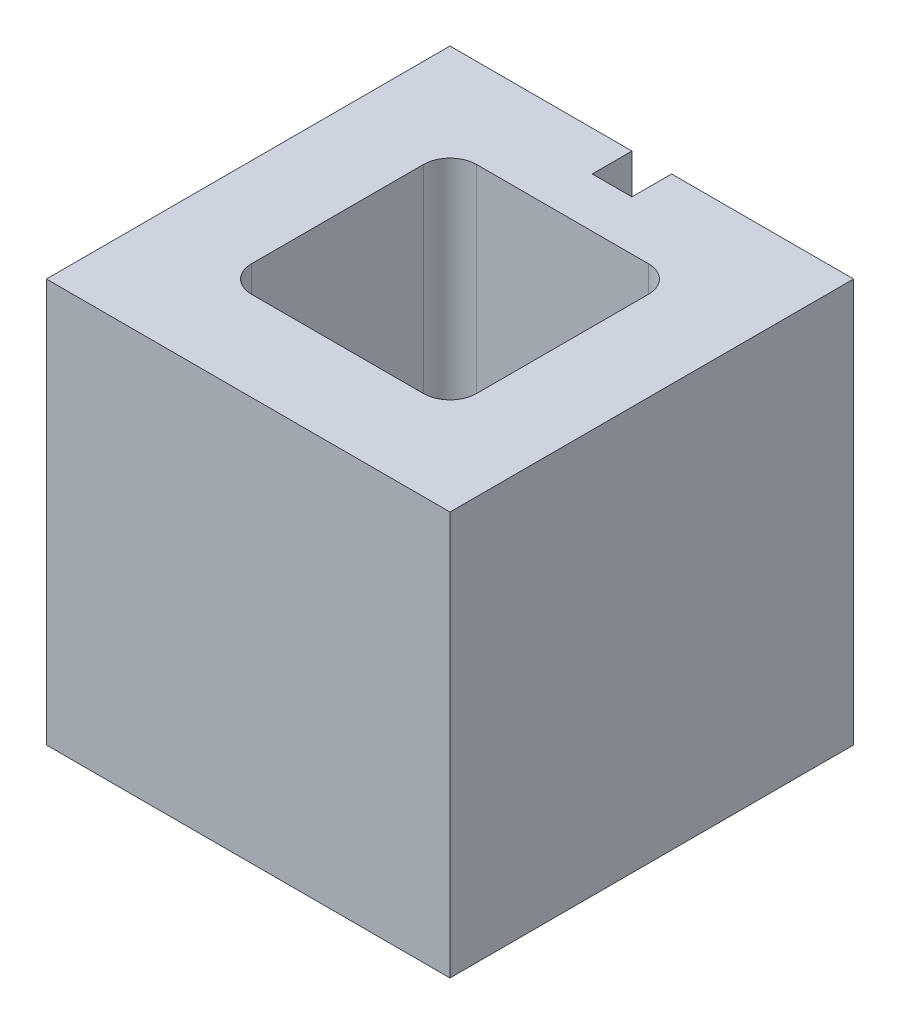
from build123d import *

# Parameters (mm, degrees)
SKETCH1_W          = 193.675
SKETCH1_H          = 193.675
EXTRUDE1_DEPTH     = 193.675
CUT_EXTRUDE1_REACH = 337.455
SKETCH2_W          = 107.95
SKETCH2_H          = 107.95
SKETCH2_W_2        = 19.05
SKETCH2_H_2        = 19.05
FILLET1_R          = 12.7


with BuildPart() as part:
    # Sketch1 → Extrude1 (new body)
    with BuildSketch(Plane(origin=(0, 0, 0), x_dir=(1, 0, 0), z_dir=(0, 1, 0))):
        with Locations((96.8375, 96.8375)):
            Rectangle(SKETCH1_W, SKETCH1_H)
    extrude(amount=EXTRUDE1_DEPTH)

    # Sketch2 → Cut-Extrude1 (cut, up to next)
    with BuildSketch(Plane(origin=(0, 193.675, 0), x_dir=(1, 0, 0), z_dir=(0, 1, 0)), mode=Mode.PRIVATE) as cut_extrude1_sk1:
        with Locations((96.8375, 96.8375)):
            Rectangle(SKETCH2_W, SKETCH2_H)
    cut_extrude1_tool1 = extrude(cut_extrude1_sk1.sketch, amount=-CUT_EXTRUDE1_REACH, mode=Mode.PRIVATE) & part.part
    # Sketch2 → Cut-Extrude1 (cut, up to next)
    with BuildSketch(Plane(origin=(0, 193.675, 0), x_dir=(1, 0, 0), z_dir=(0, 1, 0)), mode=Mode.PRIVATE) as cut_extrude1_sk2:
        with Locations((96.8375, 184.15)):
            Rectangle(SKETCH2_W_2, SKETCH2_H_2)
    cut_extrude1_tool2 = extrude(cut_extrude1_sk2.sketch, amount=-CUT_EXTRUDE1_REACH, mode=Mode.PRIVATE) & part.part
    add(cut_extrude1_tool1.solids().sort_by_distance((96.8375, 193.675, -96.8375))[0], mode=Mode.SUBTRACT)
    add(cut_extrude1_tool2.solids().sort_by_distance((96.8375, 193.675, -184.15))[0], mode=Mode.SUBTRACT)

    # Fillet1
    fillet1_edges = [part.edges().sort_by_distance(p)[0] for p in [
        (42.8625, 96.8375, -42.8625),
        (42.8625, 96.8375, -150.8125),
        (150.8125, 96.8375, -150.8125),
        (150.8125, 96.8375, -42.8625),
    ]]
    fillet(fillet1_edges, radius=FILLET1_R)


solid = part.part
